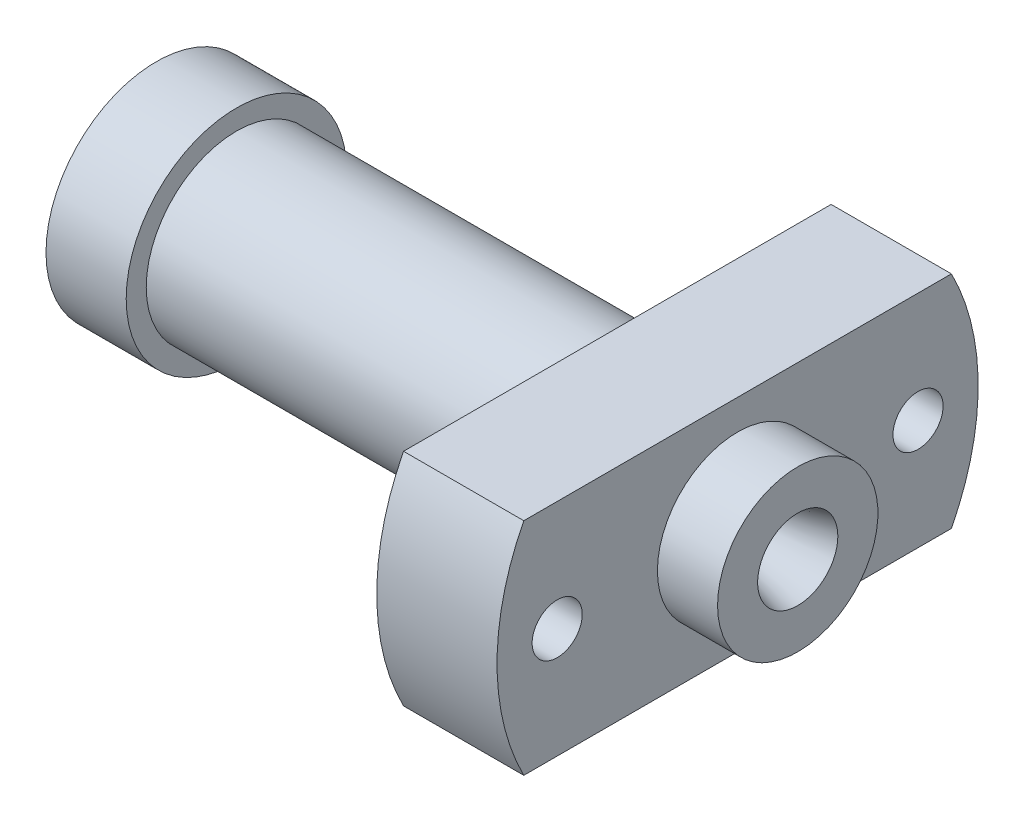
from build123d import *

# Parameters (mm, degrees)
CUT_EXTRUDE1_START      = -4
CUT_EXTRUDE1_DEPTH      = 4
M1_6_TAPPED_HOLE2_D     = 1.25
M1_6_TAPPED_HOLE2_DEPTH = 4
M1_6_TAPPED_HOLE2_TIP   = 0.375537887


with BuildPart() as part:
    # Sketch1 → Revolve1 (revolve)
    with BuildSketch(Plane.XY, mode=Mode.PRIVATE) as revolve1_sk:
        Polygon((0, 2.75), (0, 2), (2.308262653, 1.25), (11.750164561, 1.25), (12.441154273, 0.1), (12.641154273, 0.1), (16, 1), (16, 2), (14.5, 2), (14.5, 6), (11.5, 6), (11.5, 2.25), (2, 2.25), (2, 2.75), align=None)
    revolve(revolve1_sk.sketch.rotate(Axis((-6.059960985, 0, 0), (1, 0, 0)), 90), axis=Axis((-6.059960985, 0, 0), (1, 0, 0)))

    # Sketch2 → Cut-Extrude1 (cut)
    with BuildSketch(Plane(origin=(14.5, 0, 0), x_dir=(0, 0, -1), z_dir=(1, 0, 0)).offset(CUT_EXTRUDE1_START)):
        with BuildLine():
            Line((-5.332682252, 2.75), (5.332682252, 2.75))
            ThreePointArc((5.332682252, 2.75), (0, 6), (-5.332682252, 2.75))
        make_face()
        with BuildLine():
            Line((-5.332682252, -2.75), (5.332682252, -2.75))
            ThreePointArc((5.332682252, -2.75), (0, -6), (-5.332682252, -2.75))
        make_face()
    extrude(amount=CUT_EXTRUDE1_DEPTH, mode=Mode.SUBTRACT)

    # M1.6 Tapped Hole2
    with Locations(Plane(origin=(14.5, 0, 0), x_dir=(0, 0, -1), z_dir=(1, 0, 0))):
        with Locations((-4.5, 0), (4.5, 0)):
            Hole(M1_6_TAPPED_HOLE2_D / 2, depth=M1_6_TAPPED_HOLE2_DEPTH)
            with Locations((0, 0, -(M1_6_TAPPED_HOLE2_DEPTH + M1_6_TAPPED_HOLE2_TIP / 2))):  # 118° drill point
                Cone(0, M1_6_TAPPED_HOLE2_D / 2, M1_6_TAPPED_HOLE2_TIP, mode=Mode.SUBTRACT)


solid = part.part
